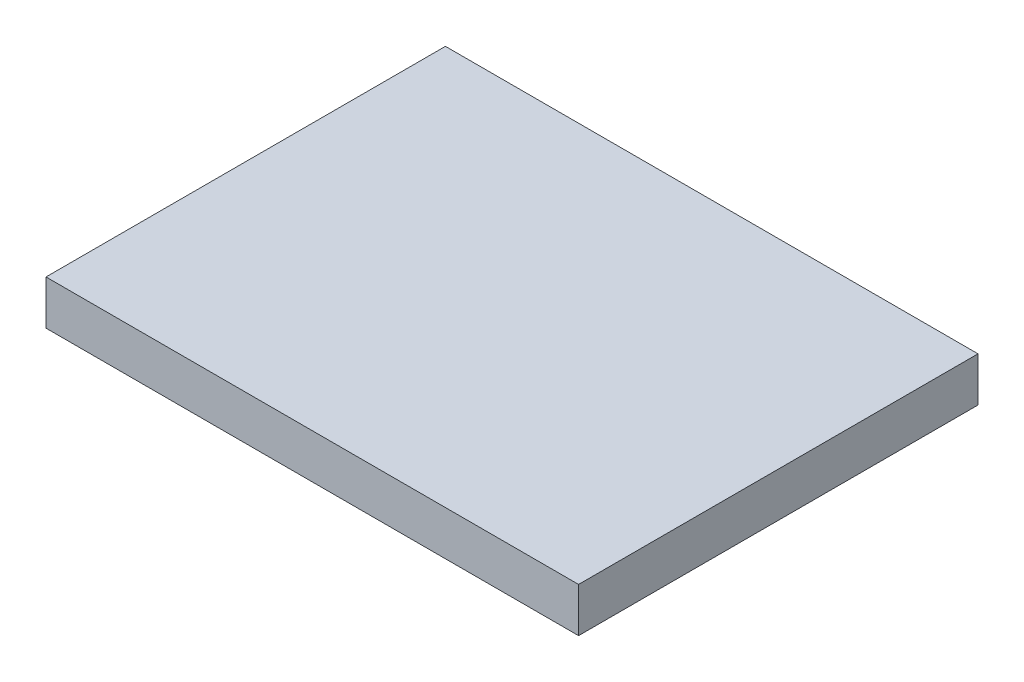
ISO-10303-21;
HEADER;
FILE_DESCRIPTION(('STEP AP214'),'2;1');
FILE_NAME('part.step','',(''),(''),'','','');
FILE_SCHEMA(('AUTOMOTIVE_DESIGN { 1 0 10303 214 1 1 1 1 }'));
ENDSEC;
DATA;
#1=APPLICATION_CONTEXT('core data for automotive mechanical design processes');
#2=APPLICATION_PROTOCOL_DEFINITION('international standard','automotive_design',2000,#1);
#3=PRODUCT_CONTEXT('',#1,'mechanical');
#4=PRODUCT('Part','Part','',(#3));
#5=PRODUCT_RELATED_PRODUCT_CATEGORY('part','',(#4));
#6=PRODUCT_DEFINITION_FORMATION('','',#4);
#7=PRODUCT_DEFINITION_CONTEXT('part definition',#1,'design');
#8=PRODUCT_DEFINITION('design','',#6,#7);
#9=PRODUCT_DEFINITION_SHAPE('','',#8);
#10=(LENGTH_UNIT() NAMED_UNIT(*) SI_UNIT(.MILLI.,.METRE.));
#11=(NAMED_UNIT(*) PLANE_ANGLE_UNIT() SI_UNIT($,.RADIAN.));
#12=(NAMED_UNIT(*) SI_UNIT($,.STERADIAN.) SOLID_ANGLE_UNIT());
#13=UNCERTAINTY_MEASURE_WITH_UNIT(LENGTH_MEASURE(1.E-05),#10,'distance_accuracy_value','');
#14=(GEOMETRIC_REPRESENTATION_CONTEXT(3) GLOBAL_UNCERTAINTY_ASSIGNED_CONTEXT((#13)) GLOBAL_UNIT_ASSIGNED_CONTEXT((#10,
#11,#12)) REPRESENTATION_CONTEXT('',''));
#15=CARTESIAN_POINT('',(0.,0.,0.));
#16=DIRECTION('',(0.,0.,1.));
#17=DIRECTION('',(1.,0.,0.));
#18=AXIS2_PLACEMENT_3D('',#15,#16,#17);
#19=CARTESIAN_POINT('',(-60.,1306.5,0.));
#20=DIRECTION('',(0.,0.,1.));
#21=DIRECTION('',(1.,0.,0.));
#22=AXIS2_PLACEMENT_3D('',#19,#20,#21);
#23=PLANE('',#22);
#24=DIRECTION('',(0.,-1.,0.));
#25=VECTOR('',#24,1.);
#26=CARTESIAN_POINT('',(-60.,1316.5,0.));
#27=LINE('',#26,#25);
#28=CARTESIAN_POINT('',(-60.,1316.5,0.));
#29=VERTEX_POINT('',#28);
#30=CARTESIAN_POINT('',(-60.,1306.5,0.));
#31=VERTEX_POINT('',#30);
#32=EDGE_CURVE('E80',#29,#31,#27,.T.);
#33=ORIENTED_EDGE('',*,*,#32,.F.);
#34=DIRECTION('',(-1.,0.,0.));
#35=VECTOR('',#34,1.);
#36=CARTESIAN_POINT('',(-60.,1316.5,0.));
#37=LINE('',#36,#35);
#38=CARTESIAN_POINT('',(60.,1316.5,0.));
#39=VERTEX_POINT('',#38);
#40=EDGE_CURVE('E91',#39,#29,#37,.T.);
#41=ORIENTED_EDGE('',*,*,#40,.F.);
#42=DIRECTION('',(0.,1.,0.));
#43=VECTOR('',#42,1.);
#44=CARTESIAN_POINT('',(60.,1316.5,0.));
#45=LINE('',#44,#43);
#46=CARTESIAN_POINT('',(60.,1306.5,0.));
#47=VERTEX_POINT('',#46);
#48=EDGE_CURVE('E82',#47,#39,#45,.T.);
#49=ORIENTED_EDGE('',*,*,#48,.F.);
#50=DIRECTION('',(1.,0.,0.));
#51=VECTOR('',#50,1.);
#52=CARTESIAN_POINT('',(-60.,1306.5,0.));
#53=LINE('',#52,#51);
#54=EDGE_CURVE('E70',#31,#47,#53,.T.);
#55=ORIENTED_EDGE('',*,*,#54,.F.);
#56=EDGE_LOOP('',(#33,#41,#49,#55));
#57=FACE_BOUND('',#56,.T.);
#58=ADVANCED_FACE('F31',(#57),#23,.F.);
#59=CARTESIAN_POINT('',(-60.,1316.5,210.415945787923));
#60=DIRECTION('',(0.,-1.,0.));
#61=DIRECTION('',(0.,0.,-1.));
#62=AXIS2_PLACEMENT_3D('',#59,#60,#61);
#63=PLANE('',#62);
#64=DIRECTION('',(0.,0.,-1.));
#65=VECTOR('',#64,1.);
#66=CARTESIAN_POINT('',(-60.,1316.5,210.415945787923));
#67=LINE('',#66,#65);
#68=CARTESIAN_POINT('',(-60.,1316.5,90.));
#69=VERTEX_POINT('',#68);
#70=EDGE_CURVE('E85',#69,#29,#67,.T.);
#71=ORIENTED_EDGE('',*,*,#70,.F.);
#72=DIRECTION('',(1.,0.,0.));
#73=VECTOR('',#72,1.);
#74=CARTESIAN_POINT('',(-60.,1316.5,90.));
#75=LINE('',#74,#73);
#76=CARTESIAN_POINT('',(60.,1316.5,90.));
#77=VERTEX_POINT('',#76);
#78=EDGE_CURVE('E74',#69,#77,#75,.T.);
#79=ORIENTED_EDGE('',*,*,#78,.T.);
#80=DIRECTION('',(0.,0.,-1.));
#81=VECTOR('',#80,1.);
#82=CARTESIAN_POINT('',(60.,1316.5,210.415945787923));
#83=LINE('',#82,#81);
#84=EDGE_CURVE('E94',#77,#39,#83,.T.);
#85=ORIENTED_EDGE('',*,*,#84,.T.);
#86=ORIENTED_EDGE('',*,*,#40,.T.);
#87=EDGE_LOOP('',(#71,#79,#85,#86));
#88=FACE_BOUND('',#87,.T.);
#89=ADVANCED_FACE('F105',(#88),#63,.F.);
#90=CARTESIAN_POINT('',(60.,1316.5,210.415945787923));
#91=DIRECTION('',(-1.,0.,0.));
#92=DIRECTION('',(0.,0.,1.));
#93=AXIS2_PLACEMENT_3D('',#90,#91,#92);
#94=PLANE('',#93);
#95=ORIENTED_EDGE('',*,*,#84,.F.);
#96=DIRECTION('',(0.,-1.,0.));
#97=VECTOR('',#96,1.);
#98=CARTESIAN_POINT('',(60.,1316.5,90.));
#99=LINE('',#98,#97);
#100=CARTESIAN_POINT('',(60.,1306.5,90.));
#101=VERTEX_POINT('',#100);
#102=EDGE_CURVE('E98',#77,#101,#99,.T.);
#103=ORIENTED_EDGE('',*,*,#102,.T.);
#104=DIRECTION('',(0.,0.,-1.));
#105=VECTOR('',#104,1.);
#106=CARTESIAN_POINT('',(60.,1306.5,210.415945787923));
#107=LINE('',#106,#105);
#108=EDGE_CURVE('E75',#101,#47,#107,.T.);
#109=ORIENTED_EDGE('',*,*,#108,.T.);
#110=ORIENTED_EDGE('',*,*,#48,.T.);
#111=EDGE_LOOP('',(#95,#103,#109,#110));
#112=FACE_BOUND('',#111,.T.);
#113=ADVANCED_FACE('F102',(#112),#94,.F.);
#114=CARTESIAN_POINT('',(-60.,1306.5,210.415945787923));
#115=DIRECTION('',(0.,1.,0.));
#116=DIRECTION('',(0.,0.,1.));
#117=AXIS2_PLACEMENT_3D('',#114,#115,#116);
#118=PLANE('',#117);
#119=ORIENTED_EDGE('',*,*,#108,.F.);
#120=DIRECTION('',(-1.,0.,0.));
#121=VECTOR('',#120,1.);
#122=CARTESIAN_POINT('',(-60.,1306.5,90.));
#123=LINE('',#122,#121);
#124=CARTESIAN_POINT('',(-60.,1306.5,90.));
#125=VERTEX_POINT('',#124);
#126=EDGE_CURVE('E40',#101,#125,#123,.T.);
#127=ORIENTED_EDGE('',*,*,#126,.T.);
#128=DIRECTION('',(0.,0.,-1.));
#129=VECTOR('',#128,1.);
#130=CARTESIAN_POINT('',(-60.,1306.5,210.415945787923));
#131=LINE('',#130,#129);
#132=EDGE_CURVE('E67',#125,#31,#131,.T.);
#133=ORIENTED_EDGE('',*,*,#132,.T.);
#134=ORIENTED_EDGE('',*,*,#54,.T.);
#135=EDGE_LOOP('',(#119,#127,#133,#134));
#136=FACE_BOUND('',#135,.T.);
#137=ADVANCED_FACE('F69',(#136),#118,.F.);
#138=CARTESIAN_POINT('',(-60.,1316.5,210.415945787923));
#139=DIRECTION('',(1.,0.,0.));
#140=DIRECTION('',(0.,0.,-1.));
#141=AXIS2_PLACEMENT_3D('',#138,#139,#140);
#142=PLANE('',#141);
#143=ORIENTED_EDGE('',*,*,#132,.F.);
#144=DIRECTION('',(0.,1.,0.));
#145=VECTOR('',#144,1.);
#146=CARTESIAN_POINT('',(-60.,1316.5,90.));
#147=LINE('',#146,#145);
#148=EDGE_CURVE('E11',#125,#69,#147,.T.);
#149=ORIENTED_EDGE('',*,*,#148,.T.);
#150=ORIENTED_EDGE('',*,*,#70,.T.);
#151=ORIENTED_EDGE('',*,*,#32,.T.);
#152=EDGE_LOOP('',(#143,#149,#150,#151));
#153=FACE_BOUND('',#152,.T.);
#154=ADVANCED_FACE('F33',(#153),#142,.F.);
#155=CARTESIAN_POINT('',(-60.,-1316.5,90.));
#156=DIRECTION('',(0.,0.,-1.));
#157=DIRECTION('',(0.,-1.,0.));
#158=AXIS2_PLACEMENT_3D('',#155,#156,#157);
#159=PLANE('',#158);
#160=ORIENTED_EDGE('',*,*,#102,.F.);
#161=ORIENTED_EDGE('',*,*,#78,.F.);
#162=ORIENTED_EDGE('',*,*,#148,.F.);
#163=ORIENTED_EDGE('',*,*,#126,.F.);
#164=EDGE_LOOP('',(#160,#161,#162,#163));
#165=FACE_BOUND('',#164,.T.);
#166=ADVANCED_FACE('F103',(#165),#159,.F.);
#167=CLOSED_SHELL('',(#58,#89,#113,#137,#154,#166));
#168=MANIFOLD_SOLID_BREP('B2',#167);
#169=ADVANCED_BREP_SHAPE_REPRESENTATION('',(#18,#168),#14);
#170=SHAPE_DEFINITION_REPRESENTATION(#9,#169);
ENDSEC;
END-ISO-10303-21;
